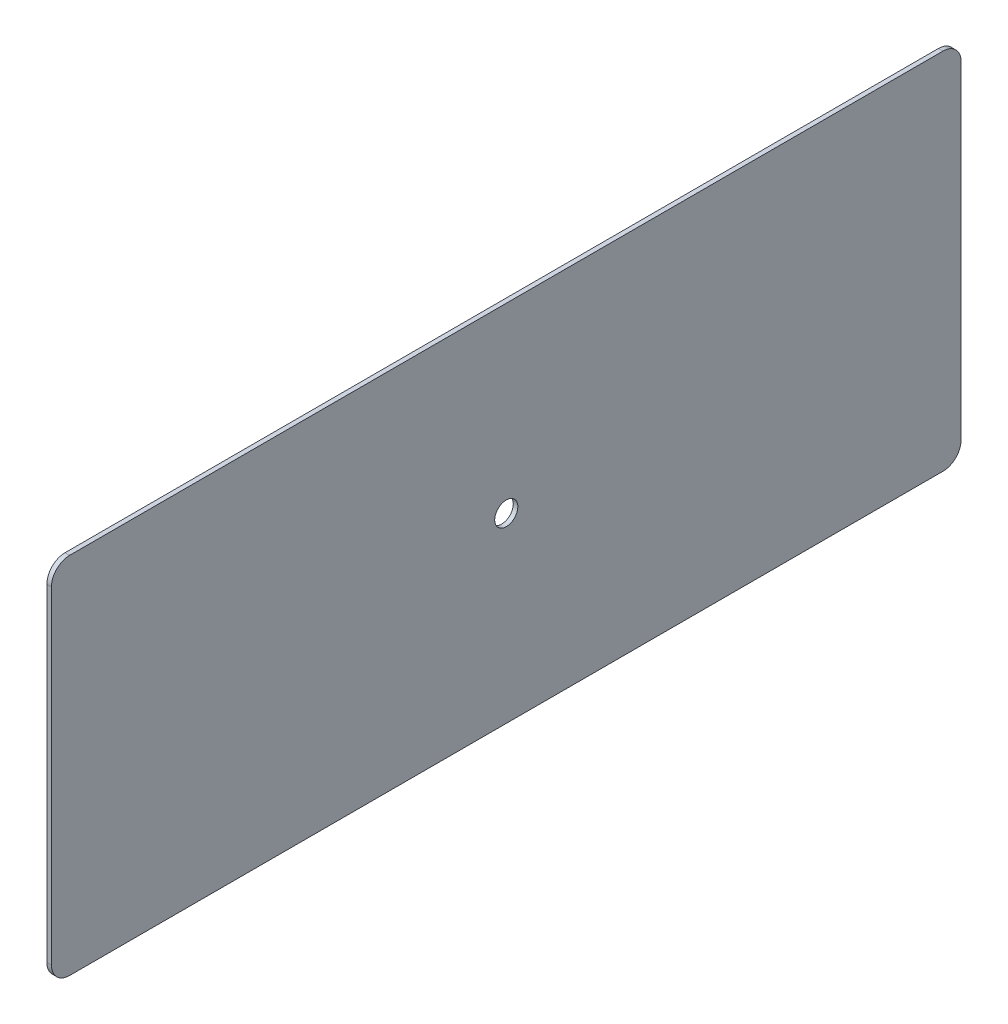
from build123d import *

# Parameters (mm, degrees)
SKETCH1_W           = 500
SKETCH1_H           = 200
SKETCH1_R           = 6.35
BOSS_EXTRUDE1_DEPTH = 2.5
FILLET1_R           = 10


with BuildPart() as part:
    # Sketch1 → Boss-Extrude1 (new body)
    with BuildSketch(Plane(origin=(0, 0, 0), x_dir=(0, 0, -1), z_dir=(1, 0, 0))):
        Rectangle(SKETCH1_W, SKETCH1_H)
        Circle(SKETCH1_R, mode=Mode.SUBTRACT)
    extrude(amount=BOSS_EXTRUDE1_DEPTH)

    # Fillet1
    fillet1_edges = [part.edges().sort_by_distance(p)[0] for p in [
        (1.25, 100, 250),
        (1.25, 100, -250),
        (1.25, -100, -250),
        (1.25, -100, 250),
    ]]
    fillet(fillet1_edges, radius=FILLET1_R)


solid = part.part
